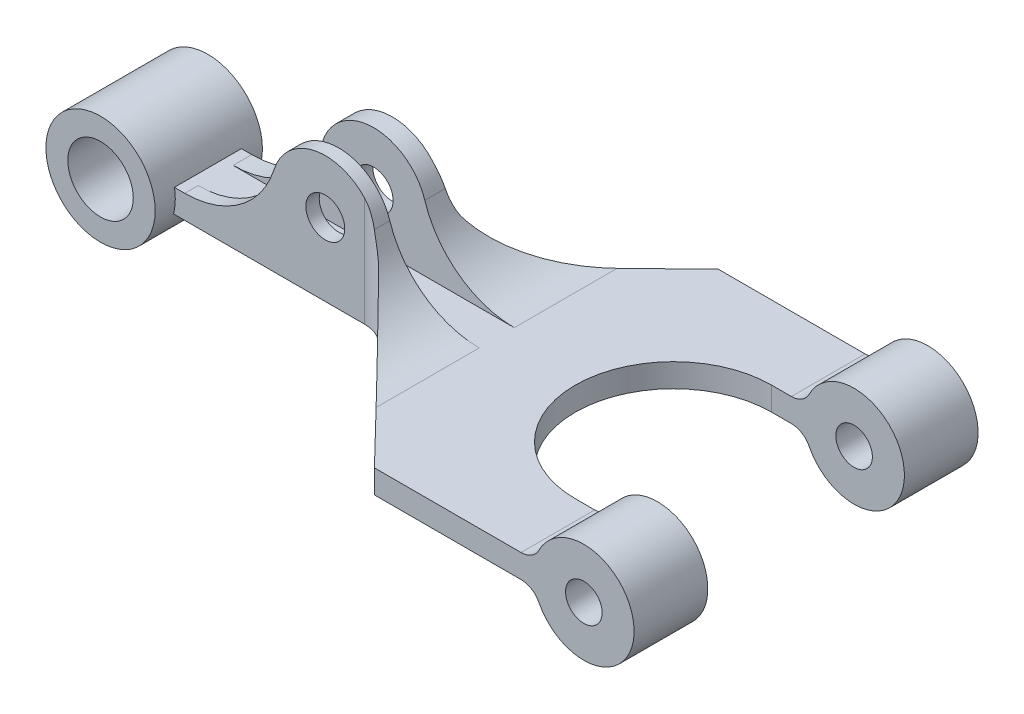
ISO-10303-21;
HEADER;
FILE_DESCRIPTION(('STEP AP214'),'2;1');
FILE_NAME('part.step','',(''),(''),'','','');
FILE_SCHEMA(('AUTOMOTIVE_DESIGN { 1 0 10303 214 1 1 1 1 }'));
ENDSEC;
DATA;
#1=APPLICATION_CONTEXT('core data for automotive mechanical design processes');
#2=APPLICATION_PROTOCOL_DEFINITION('international standard','automotive_design',2000,#1);
#3=PRODUCT_CONTEXT('',#1,'mechanical');
#4=PRODUCT('Part','Part','',(#3));
#5=PRODUCT_RELATED_PRODUCT_CATEGORY('part','',(#4));
#6=PRODUCT_DEFINITION_FORMATION('','',#4);
#7=PRODUCT_DEFINITION_CONTEXT('part definition',#1,'design');
#8=PRODUCT_DEFINITION('design','',#6,#7);
#9=PRODUCT_DEFINITION_SHAPE('','',#8);
#10=(LENGTH_UNIT() NAMED_UNIT(*) SI_UNIT(.MILLI.,.METRE.));
#11=(NAMED_UNIT(*) PLANE_ANGLE_UNIT() SI_UNIT($,.RADIAN.));
#12=(NAMED_UNIT(*) SI_UNIT($,.STERADIAN.) SOLID_ANGLE_UNIT());
#13=UNCERTAINTY_MEASURE_WITH_UNIT(LENGTH_MEASURE(1.E-05),#10,'distance_accuracy_value','');
#14=(GEOMETRIC_REPRESENTATION_CONTEXT(3) GLOBAL_UNCERTAINTY_ASSIGNED_CONTEXT((#13)) GLOBAL_UNIT_ASSIGNED_CONTEXT((#10,
#11,#12)) REPRESENTATION_CONTEXT('',''));
#15=CARTESIAN_POINT('',(0.,0.,0.));
#16=DIRECTION('',(0.,0.,1.));
#17=DIRECTION('',(1.,0.,0.));
#18=AXIS2_PLACEMENT_3D('',#15,#16,#17);
#19=CARTESIAN_POINT('',(12.7411288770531,-63.13435232,-10.));
#20=DIRECTION('',(0.,0.,1.));
#21=DIRECTION('',(1.,0.,0.));
#22=AXIS2_PLACEMENT_3D('',#19,#20,#21);
#23=CYLINDRICAL_SURFACE('',#22,8.);
#24=CARTESIAN_POINT('',(12.7411288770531,-63.13435232,-1.99189092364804));
#25=DIRECTION('',(0.,0.,-1.));
#26=DIRECTION('',(0.,1.,0.));
#27=AXIS2_PLACEMENT_3D('',#24,#25,#26);
#28=CIRCLE('',#27,8.);
#29=CARTESIAN_POINT('',(20.3687027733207,-60.7218605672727,-1.99189092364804));
#30=VERTEX_POINT('',#29);
#31=CARTESIAN_POINT('',(5.11355498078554,-60.7218605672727,-1.99189092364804));
#32=VERTEX_POINT('',#31);
#33=EDGE_CURVE('E255',#30,#32,#28,.F.);
#34=ORIENTED_EDGE('',*,*,#33,.T.);
#35=DIRECTION('',(0.,0.,1.));
#36=VECTOR('',#35,1.);
#37=CARTESIAN_POINT('',(5.11355498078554,-60.7218605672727,-10.));
#38=LINE('',#37,#36);
#39=CARTESIAN_POINT('',(5.11355498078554,-60.7218605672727,0.));
#40=VERTEX_POINT('',#39);
#41=EDGE_CURVE('E333',#32,#40,#38,.T.);
#42=ORIENTED_EDGE('',*,*,#41,.T.);
#43=CARTESIAN_POINT('',(12.7411288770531,-63.13435232,0.));
#44=DIRECTION('',(0.,0.,1.));
#45=DIRECTION('',(1.,0.,0.));
#46=AXIS2_PLACEMENT_3D('',#43,#44,#45);
#47=CIRCLE('',#46,8.);
#48=CARTESIAN_POINT('',(18.6229943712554,-57.7118382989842,0.));
#49=VERTEX_POINT('',#48);
#50=EDGE_CURVE('E313',#49,#40,#47,.T.);
#51=ORIENTED_EDGE('',*,*,#50,.F.);
#52=CARTESIAN_POINT('',(18.6229943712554,-57.7118382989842,0.));
#53=CARTESIAN_POINT('',(18.7685939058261,-57.8697280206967,2.91416028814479E-05));
#54=CARTESIAN_POINT('',(18.9076779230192,-58.0333950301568,0.00635625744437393));
#55=CARTESIAN_POINT('',(19.171906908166,-58.3708607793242,0.0284484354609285));
#56=CARTESIAN_POINT('',(19.2970617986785,-58.5446521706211,0.0442067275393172));
#57=CARTESIAN_POINT('',(19.5306743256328,-58.8980556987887,0.0816816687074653));
#58=CARTESIAN_POINT('',(19.6393857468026,-59.0775128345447,0.103289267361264));
#59=CARTESIAN_POINT('',(19.8422120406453,-59.4440324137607,0.149811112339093));
#60=CARTESIAN_POINT('',(19.9363301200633,-59.6310931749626,0.174724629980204));
#61=CARTESIAN_POINT('',(20.0893222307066,-59.9673745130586,0.219344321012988));
#62=CARTESIAN_POINT('',(20.1512914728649,-60.1152162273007,0.238906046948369));
#63=CARTESIAN_POINT('',(20.26665757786,-60.4154463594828,0.277494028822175));
#64=CARTESIAN_POINT('',(20.319993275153,-60.5678588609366,0.296515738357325));
#65=CARTESIAN_POINT('',(20.3687027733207,-60.7218605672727,0.314650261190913));
#66=B_SPLINE_CURVE_WITH_KNOTS('',3,(#52,#53,#54,#55,#56,#57,#58,#59,#60,#61,#62,#63,#64,#65),
.UNSPECIFIED.,.F.,.F.,(4,2,2,2,2,2,4),(0.,0.643821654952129,1.2871817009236,1.91928757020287,
2.55125434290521,3.0354583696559,3.52295539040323),.UNSPECIFIED.);
#67=CARTESIAN_POINT('',(20.3687027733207,-60.7218605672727,0.314650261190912));
#68=VERTEX_POINT('',#67);
#69=EDGE_CURVE('E404',#49,#68,#66,.T.);
#70=ORIENTED_EDGE('',*,*,#69,.T.);
#71=DIRECTION('',(0.,0.,1.));
#72=VECTOR('',#71,1.);
#73=CARTESIAN_POINT('',(20.3687027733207,-60.7218605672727,-10.));
#74=LINE('',#73,#72);
#75=EDGE_CURVE('E72',#68,#30,#74,.F.);
#76=ORIENTED_EDGE('',*,*,#75,.T.);
#77=EDGE_LOOP('',(#34,#42,#51,#70,#76));
#78=FACE_BOUND('',#77,.T.);
#79=ADVANCED_FACE('F43',(#78),#23,.T.);
#80=DIRECTION('',(0.,0.,1.));
#81=VECTOR('',#80,1.);
#82=CARTESIAN_POINT('',(20.3687027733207,-60.7218605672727,-10.));
#83=LINE('',#82,#81);
#84=CARTESIAN_POINT('',(20.3687027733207,-60.7218605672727,-7.21988533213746));
#85=VERTEX_POINT('',#84);
#86=CARTESIAN_POINT('',(20.3687027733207,-60.7218605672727,-10.2807551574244));
#87=VERTEX_POINT('',#86);
#88=EDGE_CURVE('E64',#85,#87,#83,.F.);
#89=ORIENTED_EDGE('',*,*,#88,.T.);
#90=CARTESIAN_POINT('',(20.3687027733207,-60.7218605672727,-10.2807551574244));
#91=CARTESIAN_POINT('',(20.3046319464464,-60.5192759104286,-10.2583697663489));
#92=CARTESIAN_POINT('',(20.2325312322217,-60.3193959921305,-10.234554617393));
#93=CARTESIAN_POINT('',(20.0726017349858,-59.925823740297,-10.1865890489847));
#94=CARTESIAN_POINT('',(19.9847565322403,-59.7321381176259,-10.1624383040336));
#95=CARTESIAN_POINT('',(19.7955420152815,-59.3556164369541,-10.1168021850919));
#96=CARTESIAN_POINT('',(19.694447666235,-59.1726471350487,-10.095276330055));
#97=CARTESIAN_POINT('',(19.4780588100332,-58.8149289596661,-10.0570681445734));
#98=CARTESIAN_POINT('',(19.3627758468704,-58.6401735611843,-10.0403819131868));
#99=CARTESIAN_POINT('',(19.1595090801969,-58.3569283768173,-10.0189676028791));
#100=CARTESIAN_POINT('',(19.075325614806,-58.2458596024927,-10.0121060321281));
#101=CARTESIAN_POINT('',(18.9006561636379,-58.0275030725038,-10.0026118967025));
#102=CARTESIAN_POINT('',(18.8101350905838,-57.9202422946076,-10.0000051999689));
#103=CARTESIAN_POINT('',(18.7168165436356,-57.8154091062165,-10.));
#104=B_SPLINE_CURVE_WITH_KNOTS('',3,(#90,#91,#92,#93,#94,#95,#96,#97,#98,#99,#100,#101,#102,
#103),.UNSPECIFIED.,.F.,.F.,(4,2,2,2,2,2,4),(0.,0.640779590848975,1.28223137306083,
1.91201914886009,2.54129786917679,2.95966838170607,3.38057307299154),.UNSPECIFIED.);
#105=CARTESIAN_POINT('',(18.7168165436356,-57.8154091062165,-10.));
#106=VERTEX_POINT('',#105);
#107=EDGE_CURVE('E11',#87,#106,#104,.T.);
#108=ORIENTED_EDGE('',*,*,#107,.T.);
#109=CARTESIAN_POINT('',(12.7411288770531,-63.13435232,-10.));
#110=DIRECTION('',(0.,0.,1.));
#111=DIRECTION('',(1.,0.,0.));
#112=AXIS2_PLACEMENT_3D('',#109,#110,#111);
#113=CIRCLE('',#112,8.);
#114=CARTESIAN_POINT('',(5.11355498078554,-60.7218605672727,-10.));
#115=VERTEX_POINT('',#114);
#116=EDGE_CURVE('E320',#106,#115,#113,.T.);
#117=ORIENTED_EDGE('',*,*,#116,.T.);
#118=DIRECTION('',(0.,0.,1.));
#119=VECTOR('',#118,1.);
#120=CARTESIAN_POINT('',(5.11355498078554,-60.7218605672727,-10.));
#121=LINE('',#120,#119);
#122=CARTESIAN_POINT('',(5.11355498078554,-60.7218605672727,-7.21988533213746));
#123=VERTEX_POINT('',#122);
#124=EDGE_CURVE('E340',#115,#123,#121,.T.);
#125=ORIENTED_EDGE('',*,*,#124,.T.);
#126=CARTESIAN_POINT('',(12.7411288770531,-63.13435232,-7.21988533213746));
#127=DIRECTION('',(0.,0.,1.));
#128=DIRECTION('',(0.,-1.,0.));
#129=AXIS2_PLACEMENT_3D('',#126,#127,#128);
#130=CIRCLE('',#129,8.);
#131=EDGE_CURVE('E493',#123,#85,#130,.F.);
#132=ORIENTED_EDGE('',*,*,#131,.T.);
#133=EDGE_LOOP('',(#89,#108,#117,#125,#132));
#134=FACE_BOUND('',#133,.T.);
#135=ADVANCED_FACE('F425',(#134),#23,.T.);
#136=CARTESIAN_POINT('',(12.7411288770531,-63.13435232,-10.));
#137=DIRECTION('',(0.,0.,1.));
#138=DIRECTION('',(1.,0.,0.));
#139=AXIS2_PLACEMENT_3D('',#136,#137,#138);
#140=CYLINDRICAL_SURFACE('',#139,2.9);
#141=CARTESIAN_POINT('',(12.7411288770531,-63.13435232,0.));
#142=DIRECTION('',(0.,0.,1.));
#143=DIRECTION('',(1.,0.,0.));
#144=AXIS2_PLACEMENT_3D('',#141,#142,#143);
#145=CIRCLE('',#144,2.9);
#146=CARTESIAN_POINT('',(15.6411288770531,-63.13435232,0.));
#147=VERTEX_POINT('',#146);
#148=EDGE_CURVE('E309',#147,#147,#145,.T.);
#149=ORIENTED_EDGE('',*,*,#148,.T.);
#150=EDGE_LOOP('',(#149));
#151=FACE_BOUND('',#150,.T.);
#152=CARTESIAN_POINT('',(12.7411288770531,-63.13435232,-1.99189092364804));
#153=DIRECTION('',(0.,0.,-1.));
#154=DIRECTION('',(0.,1.,0.));
#155=AXIS2_PLACEMENT_3D('',#152,#153,#154);
#156=CIRCLE('',#155,2.9);
#157=CARTESIAN_POINT('',(12.7411288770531,-60.23435232,-1.99189092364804));
#158=VERTEX_POINT('',#157);
#159=EDGE_CURVE('E260',#158,#158,#156,.F.);
#160=ORIENTED_EDGE('',*,*,#159,.F.);
#161=EDGE_LOOP('',(#160));
#162=FACE_BOUND('',#161,.T.);
#163=ADVANCED_FACE('F500',(#151,#162),#140,.F.);
#164=CARTESIAN_POINT('',(12.7411288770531,-63.13435232,-10.));
#165=DIRECTION('',(0.,0.,1.));
#166=DIRECTION('',(1.,0.,0.));
#167=AXIS2_PLACEMENT_3D('',#164,#165,#166);
#168=CIRCLE('',#167,2.9);
#169=CARTESIAN_POINT('',(15.6411288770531,-63.13435232,-10.));
#170=VERTEX_POINT('',#169);
#171=EDGE_CURVE('E311',#170,#170,#168,.T.);
#172=ORIENTED_EDGE('',*,*,#171,.F.);
#173=EDGE_LOOP('',(#172));
#174=FACE_BOUND('',#173,.T.);
#175=CARTESIAN_POINT('',(12.7411288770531,-63.13435232,-7.21988533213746));
#176=DIRECTION('',(0.,0.,1.));
#177=DIRECTION('',(0.,-1.,0.));
#178=AXIS2_PLACEMENT_3D('',#175,#176,#177);
#179=CIRCLE('',#178,2.9);
#180=CARTESIAN_POINT('',(12.7411288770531,-66.03435232,-7.21988533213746));
#181=VERTEX_POINT('',#180);
#182=EDGE_CURVE('E486',#181,#181,#179,.F.);
#183=ORIENTED_EDGE('',*,*,#182,.F.);
#184=EDGE_LOOP('',(#183));
#185=FACE_BOUND('',#184,.T.);
#186=ADVANCED_FACE('F497',(#174,#185),#140,.F.);
#187=CARTESIAN_POINT('',(12.7411288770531,-63.13435232,-10.));
#188=DIRECTION('',(0.,0.,1.));
#189=DIRECTION('',(1.,0.,0.));
#190=AXIS2_PLACEMENT_3D('',#187,#188,#189);
#191=PLANE('',#190);
#192=ORIENTED_EDGE('',*,*,#171,.T.);
#193=EDGE_LOOP('',(#192));
#194=FACE_BOUND('',#193,.T.);
#195=ORIENTED_EDGE('',*,*,#116,.F.);
#196=DIRECTION('',(0.,-1.,0.));
#197=VECTOR('',#196,1.);
#198=CARTESIAN_POINT('',(18.7168165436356,-74.,-10.));
#199=LINE('',#198,#197);
#200=CARTESIAN_POINT('',(18.7168165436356,-74.,-10.));
#201=VERTEX_POINT('',#200);
#202=EDGE_CURVE('E398',#106,#201,#199,.T.);
#203=ORIENTED_EDGE('',*,*,#202,.T.);
#204=DIRECTION('',(-1.,0.,0.));
#205=VECTOR('',#204,1.);
#206=CARTESIAN_POINT('',(12.7411288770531,-74.,-10.));
#207=LINE('',#206,#205);
#208=CARTESIAN_POINT('',(-9.90111649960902,-74.,-10.));
#209=VERTEX_POINT('',#208);
#210=EDGE_CURVE('E277',#201,#209,#207,.T.);
#211=ORIENTED_EDGE('',*,*,#210,.T.);
#212=CARTESIAN_POINT('',(-17.7935503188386,-71.9601711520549,-10.));
#213=DIRECTION('',(0.,0.,1.));
#214=DIRECTION('',(1.,0.,0.));
#215=AXIS2_PLACEMENT_3D('',#212,#213,#214);
#216=CIRCLE('',#215,8.15177363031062);
#217=CARTESIAN_POINT('',(-9.7736180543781,-70.5,-10.));
#218=VERTEX_POINT('',#217);
#219=EDGE_CURVE('E230',#209,#218,#216,.T.);
#220=ORIENTED_EDGE('',*,*,#219,.T.);
#221=DIRECTION('',(-1.,0.,0.));
#222=VECTOR('',#221,1.);
#223=CARTESIAN_POINT('',(12.7411288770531,-70.5,-10.));
#224=LINE('',#223,#222);
#225=CARTESIAN_POINT('',(-8.23469933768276,-70.5,-10.));
#226=VERTEX_POINT('',#225);
#227=EDGE_CURVE('E298',#226,#218,#224,.T.);
#228=ORIENTED_EDGE('',*,*,#227,.F.);
#229=CARTESIAN_POINT('',(-8.23469933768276,-56.5,-10.));
#230=DIRECTION('',(0.,0.,1.));
#231=DIRECTION('',(1.,0.,0.));
#232=AXIS2_PLACEMENT_3D('',#229,#230,#231);
#233=CIRCLE('',#232,14.);
#234=EDGE_CURVE('E344',#226,#115,#233,.T.);
#235=ORIENTED_EDGE('',*,*,#234,.T.);
#236=EDGE_LOOP('',(#195,#203,#211,#220,#228,#235));
#237=FACE_BOUND('',#236,.T.);
#238=ADVANCED_FACE('F504',(#194,#237),#191,.F.);
#239=CARTESIAN_POINT('',(12.7411288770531,-63.13435232,0.));
#240=DIRECTION('',(0.,0.,1.));
#241=DIRECTION('',(1.,0.,0.));
#242=AXIS2_PLACEMENT_3D('',#239,#240,#241);
#243=PLANE('',#242);
#244=DIRECTION('',(1.,0.,0.));
#245=VECTOR('',#244,1.);
#246=CARTESIAN_POINT('',(20.7411288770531,-74.,0.));
#247=LINE('',#246,#245);
#248=CARTESIAN_POINT('',(-9.90111649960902,-74.,0.));
#249=VERTEX_POINT('',#248);
#250=CARTESIAN_POINT('',(18.6229943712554,-74.,0.));
#251=VERTEX_POINT('',#250);
#252=EDGE_CURVE('E241',#249,#251,#247,.T.);
#253=ORIENTED_EDGE('',*,*,#252,.T.);
#254=DIRECTION('',(0.,-1.,0.));
#255=VECTOR('',#254,1.);
#256=CARTESIAN_POINT('',(18.6229943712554,-63.13435232,0.));
#257=LINE('',#256,#255);
#258=EDGE_CURVE('E397',#251,#49,#257,.F.);
#259=ORIENTED_EDGE('',*,*,#258,.T.);
#260=ORIENTED_EDGE('',*,*,#50,.T.);
#261=CARTESIAN_POINT('',(-8.23469933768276,-56.5,0.));
#262=DIRECTION('',(0.,0.,1.));
#263=DIRECTION('',(1.,0.,0.));
#264=AXIS2_PLACEMENT_3D('',#261,#262,#263);
#265=CIRCLE('',#264,14.);
#266=CARTESIAN_POINT('',(-8.23469933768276,-70.5,0.));
#267=VERTEX_POINT('',#266);
#268=EDGE_CURVE('E342',#40,#267,#265,.F.);
#269=ORIENTED_EDGE('',*,*,#268,.T.);
#270=DIRECTION('',(1.,0.,0.));
#271=VECTOR('',#270,1.);
#272=CARTESIAN_POINT('',(20.7411288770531,-70.5,0.));
#273=LINE('',#272,#271);
#274=CARTESIAN_POINT('',(-9.7736180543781,-70.5,0.));
#275=VERTEX_POINT('',#274);
#276=EDGE_CURVE('E242',#275,#267,#273,.T.);
#277=ORIENTED_EDGE('',*,*,#276,.F.);
#278=CARTESIAN_POINT('',(-17.7935503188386,-71.9601711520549,0.));
#279=DIRECTION('',(0.,0.,1.));
#280=DIRECTION('',(1.,0.,0.));
#281=AXIS2_PLACEMENT_3D('',#278,#279,#280);
#282=CIRCLE('',#281,8.15177363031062);
#283=EDGE_CURVE('E228',#249,#275,#282,.T.);
#284=ORIENTED_EDGE('',*,*,#283,.F.);
#285=EDGE_LOOP('',(#253,#259,#260,#269,#277,#284));
#286=FACE_BOUND('',#285,.T.);
#287=ORIENTED_EDGE('',*,*,#148,.F.);
#288=EDGE_LOOP('',(#287));
#289=FACE_BOUND('',#288,.T.);
#290=ADVANCED_FACE('F237',(#286,#289),#243,.T.);
#291=CARTESIAN_POINT('',(60.343112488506,-70.5,-4.33827992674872));
#292=DIRECTION('',(0.,1.,0.));
#293=DIRECTION('',(0.,0.,1.));
#294=AXIS2_PLACEMENT_3D('',#291,#292,#293);
#295=PLANE('',#294);
#296=DIRECTION('',(1.,0.,0.));
#297=VECTOR('',#296,1.);
#298=CARTESIAN_POINT('',(41.3922499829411,-70.5,21.3234401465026));
#299=LINE('',#298,#297);
#300=CARTESIAN_POINT('',(41.3922499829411,-70.5,21.3234401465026));
#301=VERTEX_POINT('',#300);
#302=CARTESIAN_POINT('',(63.2719281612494,-70.5,21.3234401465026));
#303=VERTEX_POINT('',#302);
#304=EDGE_CURVE('E282',#301,#303,#299,.T.);
#305=ORIENTED_EDGE('',*,*,#304,.T.);
#306=DIRECTION('',(0.,0.,-1.));
#307=VECTOR('',#306,1.);
#308=CARTESIAN_POINT('',(63.2719281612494,-70.5,10.3234401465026));
#309=LINE('',#308,#307);
#310=CARTESIAN_POINT('',(63.2719281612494,-70.5,10.3234401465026));
#311=VERTEX_POINT('',#310);
#312=EDGE_CURVE('E367',#303,#311,#309,.T.);
#313=ORIENTED_EDGE('',*,*,#312,.T.);
#314=DIRECTION('',(-1.,0.,0.));
#315=VECTOR('',#314,1.);
#316=CARTESIAN_POINT('',(60.343112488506,-70.5,10.3234401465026));
#317=LINE('',#316,#315);
#318=CARTESIAN_POINT('',(60.343112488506,-70.5,10.3234401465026));
#319=VERTEX_POINT('',#318);
#320=EDGE_CURVE('E281',#311,#319,#317,.T.);
#321=ORIENTED_EDGE('',*,*,#320,.T.);
#322=CARTESIAN_POINT('',(60.343112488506,-70.5,-4.33827992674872));
#323=DIRECTION('',(0.,-1.,0.));
#324=DIRECTION('',(0.,0.,1.));
#325=AXIS2_PLACEMENT_3D('',#322,#323,#324);
#326=CIRCLE('',#325,14.6617200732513);
#327=CARTESIAN_POINT('',(60.343112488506,-70.5,-19.));
#328=VERTEX_POINT('',#327);
#329=EDGE_CURVE('E287',#319,#328,#326,.T.);
#330=ORIENTED_EDGE('',*,*,#329,.T.);
#331=DIRECTION('',(1.,0.,0.));
#332=VECTOR('',#331,1.);
#333=CARTESIAN_POINT('',(65.343112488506,-70.5,-19.));
#334=LINE('',#333,#332);
#335=CARTESIAN_POINT('',(63.2719281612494,-70.5,-19.));
#336=VERTEX_POINT('',#335);
#337=EDGE_CURVE('E290',#328,#336,#334,.T.);
#338=ORIENTED_EDGE('',*,*,#337,.T.);
#339=DIRECTION('',(0.,0.,-1.));
#340=VECTOR('',#339,1.);
#341=CARTESIAN_POINT('',(63.2719281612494,-70.5,-4.33827992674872));
#342=LINE('',#341,#340);
#343=CARTESIAN_POINT('',(63.2719281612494,-70.5,-30.));
#344=VERTEX_POINT('',#343);
#345=EDGE_CURVE('E366',#336,#344,#342,.T.);
#346=ORIENTED_EDGE('',*,*,#345,.T.);
#347=DIRECTION('',(-1.,0.,0.));
#348=VECTOR('',#347,1.);
#349=CARTESIAN_POINT('',(41.3922499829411,-70.5,-30.));
#350=LINE('',#349,#348);
#351=CARTESIAN_POINT('',(41.3922499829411,-70.5,-30.));
#352=VERTEX_POINT('',#351);
#353=EDGE_CURVE('E293',#344,#352,#350,.T.);
#354=ORIENTED_EDGE('',*,*,#353,.T.);
#355=DIRECTION('',(-0.718340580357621,0.,0.695691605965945));
#356=VECTOR('',#355,1.);
#357=CARTESIAN_POINT('',(20.7411288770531,-70.5,-10.));
#358=LINE('',#357,#356);
#359=CARTESIAN_POINT('',(33.716957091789,-70.5,-22.5667058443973));
#360=VERTEX_POINT('',#359);
#361=EDGE_CURVE('E291',#352,#360,#358,.T.);
#362=ORIENTED_EDGE('',*,*,#361,.T.);
#363=DIRECTION('',(0.,0.,-1.));
#364=VECTOR('',#363,1.);
#365=CARTESIAN_POINT('',(33.716957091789,-70.5,-7.21988533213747));
#366=LINE('',#365,#364);
#367=CARTESIAN_POINT('',(33.716957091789,-70.5,-7.21988533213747));
#368=VERTEX_POINT('',#367);
#369=EDGE_CURVE('E324',#360,#368,#366,.F.);
#370=ORIENTED_EDGE('',*,*,#369,.T.);
#371=DIRECTION('',(-1.,0.,0.));
#372=VECTOR('',#371,1.);
#373=CARTESIAN_POINT('',(65.343112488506,-70.5,-7.21988533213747));
#374=LINE('',#373,#372);
#375=CARTESIAN_POINT('',(-8.23469933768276,-70.5,-7.21988533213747));
#376=VERTEX_POINT('',#375);
#377=EDGE_CURVE('E485',#368,#376,#374,.T.);
#378=ORIENTED_EDGE('',*,*,#377,.T.);
#379=DIRECTION('',(0.,0.,-1.));
#380=VECTOR('',#379,1.);
#381=CARTESIAN_POINT('',(-8.23469933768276,-70.5,-10.));
#382=LINE('',#381,#380);
#383=EDGE_CURVE('E329',#376,#226,#382,.T.);
#384=ORIENTED_EDGE('',*,*,#383,.T.);
#385=ORIENTED_EDGE('',*,*,#227,.T.);
#386=DIRECTION('',(0.,0.,1.));
#387=VECTOR('',#386,1.);
#388=CARTESIAN_POINT('',(-9.7736180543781,-70.5,-13.));
#389=LINE('',#388,#387);
#390=EDGE_CURVE('E466',#275,#218,#389,.F.);
#391=ORIENTED_EDGE('',*,*,#390,.F.);
#392=ORIENTED_EDGE('',*,*,#276,.T.);
#393=DIRECTION('',(0.,0.,-1.));
#394=VECTOR('',#393,1.);
#395=CARTESIAN_POINT('',(-8.23469933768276,-70.5,-1.99189092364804));
#396=LINE('',#395,#394);
#397=CARTESIAN_POINT('',(-8.23469933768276,-70.5,-1.99189092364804));
#398=VERTEX_POINT('',#397);
#399=EDGE_CURVE('E328',#267,#398,#396,.T.);
#400=ORIENTED_EDGE('',*,*,#399,.T.);
#401=DIRECTION('',(-1.,0.,0.));
#402=VECTOR('',#401,1.);
#403=CARTESIAN_POINT('',(65.343112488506,-70.5,-1.99189092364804));
#404=LINE('',#403,#402);
#405=CARTESIAN_POINT('',(33.716957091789,-70.5,-1.99189092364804));
#406=VERTEX_POINT('',#405);
#407=EDGE_CURVE('E470',#406,#398,#404,.T.);
#408=ORIENTED_EDGE('',*,*,#407,.F.);
#409=DIRECTION('',(0.,0.,-1.));
#410=VECTOR('',#409,1.);
#411=CARTESIAN_POINT('',(33.716957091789,-70.5,0.));
#412=LINE('',#411,#410);
#413=CARTESIAN_POINT('',(33.716957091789,-70.5,13.3982699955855));
#414=VERTEX_POINT('',#413);
#415=EDGE_CURVE('E316',#406,#414,#412,.F.);
#416=ORIENTED_EDGE('',*,*,#415,.T.);
#417=DIRECTION('',(0.695691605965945,0.,0.718340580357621));
#418=VECTOR('',#417,1.);
#419=CARTESIAN_POINT('',(20.7411288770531,-70.5,0.));
#420=LINE('',#419,#418);
#421=EDGE_CURVE('E276',#414,#301,#420,.T.);
#422=ORIENTED_EDGE('',*,*,#421,.T.);
#423=EDGE_LOOP('',(#305,#313,#321,#330,#338,#346,#354,#362,#370,#378,#384,#385,#391,#392,#400,
#408,#416,#422));
#424=FACE_BOUND('',#423,.T.);
#425=ADVANCED_FACE('F467',(#424),#295,.T.);
#426=CARTESIAN_POINT('',(20.7411288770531,-70.5,0.));
#427=DIRECTION('',(0.718340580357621,0.,-0.695691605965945));
#428=DIRECTION('',(-0.695691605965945,0.,-0.718340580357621));
#429=AXIS2_PLACEMENT_3D('',#426,#427,#428);
#430=PLANE('',#429);
#431=CARTESIAN_POINT('',(33.716957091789,-56.5,13.3982699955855));
#432=DIRECTION('',(0.718340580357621,0.,-0.695691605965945));
#433=DIRECTION('',(0.695691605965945,0.,0.718340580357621));
#434=AXIS2_PLACEMENT_3D('',#431,#432,#433);
#435=ELLIPSE('',#434,20.1238593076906,14.);
#436=CARTESIAN_POINT('',(22.2146972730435,-64.481103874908,1.52154197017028));
#437=VERTEX_POINT('',#436);
#438=EDGE_CURVE('E355',#414,#437,#435,.T.);
#439=ORIENTED_EDGE('',*,*,#438,.T.);
#440=DIRECTION('',(0.,-1.,0.));
#441=VECTOR('',#440,1.);
#442=CARTESIAN_POINT('',(22.2146972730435,-70.5,1.52154197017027));
#443=LINE('',#442,#441);
#444=CARTESIAN_POINT('',(22.2146972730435,-74.,1.52154197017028));
#445=VERTEX_POINT('',#444);
#446=EDGE_CURVE('E395',#437,#445,#443,.T.);
#447=ORIENTED_EDGE('',*,*,#446,.T.);
#448=DIRECTION('',(0.695691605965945,0.,0.718340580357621));
#449=VECTOR('',#448,1.);
#450=CARTESIAN_POINT('',(20.7411288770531,-74.,0.));
#451=LINE('',#450,#449);
#452=CARTESIAN_POINT('',(41.3922499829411,-74.,21.3234401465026));
#453=VERTEX_POINT('',#452);
#454=EDGE_CURVE('E252',#445,#453,#451,.T.);
#455=ORIENTED_EDGE('',*,*,#454,.T.);
#456=DIRECTION('',(0.,-1.,0.));
#457=VECTOR('',#456,1.);
#458=CARTESIAN_POINT('',(41.3922499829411,-70.5,21.3234401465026));
#459=LINE('',#458,#457);
#460=EDGE_CURVE('E310',#301,#453,#459,.T.);
#461=ORIENTED_EDGE('',*,*,#460,.F.);
#462=ORIENTED_EDGE('',*,*,#421,.F.);
#463=EDGE_LOOP('',(#439,#447,#455,#461,#462));
#464=FACE_BOUND('',#463,.T.);
#465=ADVANCED_FACE('F456',(#464),#430,.F.);
#466=CARTESIAN_POINT('',(41.3922499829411,-70.5,21.3234401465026));
#467=DIRECTION('',(0.,0.,-1.));
#468=DIRECTION('',(-1.,0.,0.));
#469=AXIS2_PLACEMENT_3D('',#466,#467,#468);
#470=PLANE('',#469);
#471=DIRECTION('',(1.,0.,0.));
#472=VECTOR('',#471,1.);
#473=CARTESIAN_POINT('',(41.3922499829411,-74.,21.3234401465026));
#474=LINE('',#473,#472);
#475=CARTESIAN_POINT('',(63.2719281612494,-74.,21.3234401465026));
#476=VERTEX_POINT('',#475);
#477=EDGE_CURVE('E251',#453,#476,#474,.T.);
#478=ORIENTED_EDGE('',*,*,#477,.T.);
#479=CARTESIAN_POINT('',(63.2719281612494,-77.,21.3234401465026));
#480=DIRECTION('',(0.,0.,-1.));
#481=DIRECTION('',(-1.,0.,0.));
#482=AXIS2_PLACEMENT_3D('',#479,#480,#481);
#483=CIRCLE('',#482,3.);
#484=CARTESIAN_POINT('',(65.9474025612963,-75.6428571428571,21.3234401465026));
#485=VERTEX_POINT('',#484);
#486=EDGE_CURVE('E378',#476,#485,#483,.T.);
#487=ORIENTED_EDGE('',*,*,#486,.T.);
#488=CARTESIAN_POINT('',(72.6360885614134,-72.25,21.3234401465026));
#489=DIRECTION('',(0.,0.,1.));
#490=DIRECTION('',(1.,0.,0.));
#491=AXIS2_PLACEMENT_3D('',#488,#489,#490);
#492=CIRCLE('',#491,7.50000000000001);
#493=CARTESIAN_POINT('',(65.9474025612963,-68.8571428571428,21.3234401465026));
#494=VERTEX_POINT('',#493);
#495=EDGE_CURVE('E479',#485,#494,#492,.T.);
#496=ORIENTED_EDGE('',*,*,#495,.T.);
#497=CARTESIAN_POINT('',(63.2719281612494,-67.5,21.3234401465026));
#498=DIRECTION('',(0.,0.,-1.));
#499=DIRECTION('',(-1.,0.,0.));
#500=AXIS2_PLACEMENT_3D('',#497,#498,#499);
#501=CIRCLE('',#500,3.);
#502=EDGE_CURVE('E384',#494,#303,#501,.T.);
#503=ORIENTED_EDGE('',*,*,#502,.T.);
#504=ORIENTED_EDGE('',*,*,#304,.F.);
#505=ORIENTED_EDGE('',*,*,#460,.T.);
#506=EDGE_LOOP('',(#478,#487,#496,#503,#504,#505));
#507=FACE_BOUND('',#506,.T.);
#508=CARTESIAN_POINT('',(72.6360885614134,-72.25,21.3234401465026));
#509=DIRECTION('',(0.,0.,1.));
#510=DIRECTION('',(1.,0.,0.));
#511=AXIS2_PLACEMENT_3D('',#508,#509,#510);
#512=CIRCLE('',#511,2.72660472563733);
#513=CARTESIAN_POINT('',(75.3626932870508,-72.25,21.3234401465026));
#514=VERTEX_POINT('',#513);
#515=EDGE_CURVE('E468',#514,#514,#512,.T.);
#516=ORIENTED_EDGE('',*,*,#515,.F.);
#517=EDGE_LOOP('',(#516));
#518=FACE_BOUND('',#517,.T.);
#519=ADVANCED_FACE('F620',(#507,#518),#470,.F.);
#520=CARTESIAN_POINT('',(60.343112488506,-70.5,10.3234401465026));
#521=DIRECTION('',(0.,0.,1.));
#522=DIRECTION('',(1.,0.,0.));
#523=AXIS2_PLACEMENT_3D('',#520,#521,#522);
#524=PLANE('',#523);
#525=ORIENTED_EDGE('',*,*,#320,.F.);
#526=CARTESIAN_POINT('',(63.2719281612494,-67.5,10.3234401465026));
#527=DIRECTION('',(0.,0.,1.));
#528=DIRECTION('',(1.,0.,0.));
#529=AXIS2_PLACEMENT_3D('',#526,#527,#528);
#530=CIRCLE('',#529,3.);
#531=CARTESIAN_POINT('',(65.9474025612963,-68.8571428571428,10.3234401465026));
#532=VERTEX_POINT('',#531);
#533=EDGE_CURVE('E382',#311,#532,#530,.T.);
#534=ORIENTED_EDGE('',*,*,#533,.T.);
#535=CARTESIAN_POINT('',(72.6360885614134,-72.25,10.3234401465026));
#536=DIRECTION('',(0.,0.,1.));
#537=DIRECTION('',(1.,0.,0.));
#538=AXIS2_PLACEMENT_3D('',#535,#536,#537);
#539=CIRCLE('',#538,7.50000000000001);
#540=CARTESIAN_POINT('',(65.9474025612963,-75.6428571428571,10.3234401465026));
#541=VERTEX_POINT('',#540);
#542=EDGE_CURVE('E478',#541,#532,#539,.T.);
#543=ORIENTED_EDGE('',*,*,#542,.F.);
#544=CARTESIAN_POINT('',(63.2719281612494,-77.,10.3234401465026));
#545=DIRECTION('',(0.,0.,1.));
#546=DIRECTION('',(1.,0.,0.));
#547=AXIS2_PLACEMENT_3D('',#544,#545,#546);
#548=CIRCLE('',#547,3.);
#549=CARTESIAN_POINT('',(63.2719281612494,-74.,10.3234401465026));
#550=VERTEX_POINT('',#549);
#551=EDGE_CURVE('E380',#541,#550,#548,.T.);
#552=ORIENTED_EDGE('',*,*,#551,.T.);
#553=DIRECTION('',(-1.,0.,0.));
#554=VECTOR('',#553,1.);
#555=CARTESIAN_POINT('',(60.343112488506,-74.,10.3234401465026));
#556=LINE('',#555,#554);
#557=CARTESIAN_POINT('',(60.343112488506,-74.,10.3234401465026));
#558=VERTEX_POINT('',#557);
#559=EDGE_CURVE('E265',#550,#558,#556,.T.);
#560=ORIENTED_EDGE('',*,*,#559,.T.);
#561=DIRECTION('',(0.,-1.,0.));
#562=VECTOR('',#561,1.);
#563=CARTESIAN_POINT('',(60.343112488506,-70.5,10.3234401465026));
#564=LINE('',#563,#562);
#565=EDGE_CURVE('E302',#319,#558,#564,.T.);
#566=ORIENTED_EDGE('',*,*,#565,.F.);
#567=EDGE_LOOP('',(#525,#534,#543,#552,#560,#566));
#568=FACE_BOUND('',#567,.T.);
#569=CARTESIAN_POINT('',(72.6360885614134,-72.25,10.3234401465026));
#570=DIRECTION('',(0.,0.,1.));
#571=DIRECTION('',(1.,0.,0.));
#572=AXIS2_PLACEMENT_3D('',#569,#570,#571);
#573=CIRCLE('',#572,2.72660472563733);
#574=CARTESIAN_POINT('',(75.3626932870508,-72.25,10.3234401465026));
#575=VERTEX_POINT('',#574);
#576=EDGE_CURVE('E474',#575,#575,#573,.T.);
#577=ORIENTED_EDGE('',*,*,#576,.T.);
#578=EDGE_LOOP('',(#577));
#579=FACE_BOUND('',#578,.T.);
#580=ADVANCED_FACE('F618',(#568,#579),#524,.F.);
#581=CARTESIAN_POINT('',(60.343112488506,-70.5,-4.33827992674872));
#582=DIRECTION('',(0.,-1.,0.));
#583=DIRECTION('',(0.,0.,-1.));
#584=AXIS2_PLACEMENT_3D('',#581,#582,#583);
#585=CYLINDRICAL_SURFACE('',#584,14.6617200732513);
#586=ORIENTED_EDGE('',*,*,#565,.T.);
#587=CARTESIAN_POINT('',(60.343112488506,-74.,-4.33827992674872));
#588=DIRECTION('',(0.,-1.,0.));
#589=DIRECTION('',(0.,0.,1.));
#590=AXIS2_PLACEMENT_3D('',#587,#588,#589);
#591=CIRCLE('',#590,14.6617200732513);
#592=CARTESIAN_POINT('',(60.343112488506,-74.,-19.));
#593=VERTEX_POINT('',#592);
#594=EDGE_CURVE('E262',#558,#593,#591,.T.);
#595=ORIENTED_EDGE('',*,*,#594,.T.);
#596=DIRECTION('',(0.,-1.,0.));
#597=VECTOR('',#596,1.);
#598=CARTESIAN_POINT('',(60.343112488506,-70.5,-19.));
#599=LINE('',#598,#597);
#600=EDGE_CURVE('E305',#328,#593,#599,.T.);
#601=ORIENTED_EDGE('',*,*,#600,.F.);
#602=ORIENTED_EDGE('',*,*,#329,.F.);
#603=EDGE_LOOP('',(#586,#595,#601,#602));
#604=FACE_BOUND('',#603,.T.);
#605=ADVANCED_FACE('F615',(#604),#585,.F.);
#606=CARTESIAN_POINT('',(65.343112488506,-70.5,-19.));
#607=DIRECTION('',(0.,0.,-1.));
#608=DIRECTION('',(-1.,0.,0.));
#609=AXIS2_PLACEMENT_3D('',#606,#607,#608);
#610=PLANE('',#609);
#611=DIRECTION('',(1.,0.,0.));
#612=VECTOR('',#611,1.);
#613=CARTESIAN_POINT('',(65.343112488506,-74.,-19.));
#614=LINE('',#613,#612);
#615=CARTESIAN_POINT('',(63.2719281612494,-74.,-19.));
#616=VERTEX_POINT('',#615);
#617=EDGE_CURVE('E268',#593,#616,#614,.T.);
#618=ORIENTED_EDGE('',*,*,#617,.T.);
#619=CARTESIAN_POINT('',(63.2719281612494,-77.,-19.));
#620=DIRECTION('',(0.,0.,-1.));
#621=DIRECTION('',(-1.,0.,0.));
#622=AXIS2_PLACEMENT_3D('',#619,#620,#621);
#623=CIRCLE('',#622,3.);
#624=CARTESIAN_POINT('',(65.9474025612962,-75.6428571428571,-19.));
#625=VERTEX_POINT('',#624);
#626=EDGE_CURVE('E390',#616,#625,#623,.T.);
#627=ORIENTED_EDGE('',*,*,#626,.T.);
#628=CARTESIAN_POINT('',(72.6360885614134,-72.25,-19.));
#629=DIRECTION('',(0.,0.,1.));
#630=DIRECTION('',(1.,0.,0.));
#631=AXIS2_PLACEMENT_3D('',#628,#629,#630);
#632=CIRCLE('',#631,7.5);
#633=CARTESIAN_POINT('',(65.9474025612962,-68.8571428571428,-19.));
#634=VERTEX_POINT('',#633);
#635=EDGE_CURVE('E543',#625,#634,#632,.T.);
#636=ORIENTED_EDGE('',*,*,#635,.T.);
#637=CARTESIAN_POINT('',(63.2719281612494,-67.5,-19.));
#638=DIRECTION('',(0.,0.,-1.));
#639=DIRECTION('',(-1.,0.,0.));
#640=AXIS2_PLACEMENT_3D('',#637,#638,#639);
#641=CIRCLE('',#640,3.);
#642=EDGE_CURVE('E394',#634,#336,#641,.T.);
#643=ORIENTED_EDGE('',*,*,#642,.T.);
#644=ORIENTED_EDGE('',*,*,#337,.F.);
#645=ORIENTED_EDGE('',*,*,#600,.T.);
#646=EDGE_LOOP('',(#618,#627,#636,#643,#644,#645));
#647=FACE_BOUND('',#646,.T.);
#648=CARTESIAN_POINT('',(72.6360885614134,-72.25,-19.));
#649=DIRECTION('',(0.,0.,1.));
#650=DIRECTION('',(1.,0.,0.));
#651=AXIS2_PLACEMENT_3D('',#648,#649,#650);
#652=CIRCLE('',#651,2.72500000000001);
#653=CARTESIAN_POINT('',(75.3610885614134,-72.25,-19.));
#654=VERTEX_POINT('',#653);
#655=EDGE_CURVE('E556',#654,#654,#652,.T.);
#656=ORIENTED_EDGE('',*,*,#655,.F.);
#657=EDGE_LOOP('',(#656));
#658=FACE_BOUND('',#657,.T.);
#659=ADVANCED_FACE('F544',(#647,#658),#610,.F.);
#660=CARTESIAN_POINT('',(41.3922499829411,-70.5,-30.));
#661=DIRECTION('',(0.,0.,1.));
#662=DIRECTION('',(1.,0.,0.));
#663=AXIS2_PLACEMENT_3D('',#660,#661,#662);
#664=PLANE('',#663);
#665=ORIENTED_EDGE('',*,*,#353,.F.);
#666=CARTESIAN_POINT('',(63.2719281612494,-67.5,-30.));
#667=DIRECTION('',(0.,0.,1.));
#668=DIRECTION('',(1.,0.,0.));
#669=AXIS2_PLACEMENT_3D('',#666,#667,#668);
#670=CIRCLE('',#669,3.);
#671=CARTESIAN_POINT('',(65.9474025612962,-68.8571428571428,-30.));
#672=VERTEX_POINT('',#671);
#673=EDGE_CURVE('E386',#344,#672,#670,.T.);
#674=ORIENTED_EDGE('',*,*,#673,.T.);
#675=CARTESIAN_POINT('',(72.6360885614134,-72.25,-30.));
#676=DIRECTION('',(0.,0.,1.));
#677=DIRECTION('',(1.,0.,0.));
#678=AXIS2_PLACEMENT_3D('',#675,#676,#677);
#679=CIRCLE('',#678,7.5);
#680=CARTESIAN_POINT('',(65.9474025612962,-75.6428571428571,-30.));
#681=VERTEX_POINT('',#680);
#682=EDGE_CURVE('E551',#681,#672,#679,.T.);
#683=ORIENTED_EDGE('',*,*,#682,.F.);
#684=CARTESIAN_POINT('',(63.2719281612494,-77.,-30.));
#685=DIRECTION('',(0.,0.,1.));
#686=DIRECTION('',(1.,0.,0.));
#687=AXIS2_PLACEMENT_3D('',#684,#685,#686);
#688=CIRCLE('',#687,3.);
#689=CARTESIAN_POINT('',(63.2719281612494,-74.,-30.));
#690=VERTEX_POINT('',#689);
#691=EDGE_CURVE('E383',#681,#690,#688,.T.);
#692=ORIENTED_EDGE('',*,*,#691,.T.);
#693=DIRECTION('',(-1.,0.,0.));
#694=VECTOR('',#693,1.);
#695=CARTESIAN_POINT('',(41.3922499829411,-74.,-30.));
#696=LINE('',#695,#694);
#697=CARTESIAN_POINT('',(41.3922499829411,-74.,-30.));
#698=VERTEX_POINT('',#697);
#699=EDGE_CURVE('E272',#690,#698,#696,.T.);
#700=ORIENTED_EDGE('',*,*,#699,.T.);
#701=DIRECTION('',(0.,-1.,0.));
#702=VECTOR('',#701,1.);
#703=CARTESIAN_POINT('',(41.3922499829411,-70.5,-30.));
#704=LINE('',#703,#702);
#705=EDGE_CURVE('E299',#352,#698,#704,.T.);
#706=ORIENTED_EDGE('',*,*,#705,.F.);
#707=EDGE_LOOP('',(#665,#674,#683,#692,#700,#706));
#708=FACE_BOUND('',#707,.T.);
#709=CARTESIAN_POINT('',(72.6360885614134,-72.25,-30.));
#710=DIRECTION('',(0.,0.,1.));
#711=DIRECTION('',(1.,0.,0.));
#712=AXIS2_PLACEMENT_3D('',#709,#710,#711);
#713=CIRCLE('',#712,2.72500000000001);
#714=CARTESIAN_POINT('',(75.3610885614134,-72.25,-30.));
#715=VERTEX_POINT('',#714);
#716=EDGE_CURVE('E561',#715,#715,#713,.T.);
#717=ORIENTED_EDGE('',*,*,#716,.T.);
#718=EDGE_LOOP('',(#717));
#719=FACE_BOUND('',#718,.T.);
#720=ADVANCED_FACE('F609',(#708,#719),#664,.F.);
#721=CARTESIAN_POINT('',(20.7411288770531,-70.5,-10.));
#722=DIRECTION('',(0.695691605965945,0.,0.718340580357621));
#723=DIRECTION('',(0.718340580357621,0.,-0.695691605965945));
#724=AXIS2_PLACEMENT_3D('',#721,#722,#723);
#725=PLANE('',#724);
#726=DIRECTION('',(-0.718340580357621,0.,0.695691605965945));
#727=VECTOR('',#726,1.);
#728=CARTESIAN_POINT('',(20.7411288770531,-74.,-10.));
#729=LINE('',#728,#727);
#730=CARTESIAN_POINT('',(22.1952745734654,-74.,-11.4082970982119));
#731=VERTEX_POINT('',#730);
#732=EDGE_CURVE('E271',#698,#731,#729,.T.);
#733=ORIENTED_EDGE('',*,*,#732,.T.);
#734=DIRECTION('',(0.,-1.,0.));
#735=VECTOR('',#734,1.);
#736=CARTESIAN_POINT('',(22.1952745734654,-61.7562231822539,-11.4082970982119));
#737=LINE('',#736,#735);
#738=CARTESIAN_POINT('',(22.1952745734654,-64.4530391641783,-11.4082970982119));
#739=VERTEX_POINT('',#738);
#740=EDGE_CURVE('E402',#731,#739,#737,.F.);
#741=ORIENTED_EDGE('',*,*,#740,.T.);
#742=CARTESIAN_POINT('',(33.716957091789,-56.5,-22.5667058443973));
#743=DIRECTION('',(0.695691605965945,0.,0.718340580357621));
#744=DIRECTION('',(-0.718340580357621,0.,0.695691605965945));
#745=AXIS2_PLACEMENT_3D('',#742,#743,#744);
#746=ELLIPSE('',#745,19.4893625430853,14.);
#747=EDGE_CURVE('E352',#739,#360,#746,.T.);
#748=ORIENTED_EDGE('',*,*,#747,.T.);
#749=ORIENTED_EDGE('',*,*,#361,.F.);
#750=ORIENTED_EDGE('',*,*,#705,.T.);
#751=EDGE_LOOP('',(#733,#741,#748,#749,#750));
#752=FACE_BOUND('',#751,.T.);
#753=ADVANCED_FACE('F527',(#752),#725,.F.);
#754=CARTESIAN_POINT('',(60.343112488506,-74.,-4.33827992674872));
#755=DIRECTION('',(0.,1.,0.));
#756=DIRECTION('',(0.,0.,1.));
#757=AXIS2_PLACEMENT_3D('',#754,#755,#756);
#758=PLANE('',#757);
#759=ORIENTED_EDGE('',*,*,#559,.F.);
#760=DIRECTION('',(0.,0.,1.));
#761=VECTOR('',#760,1.);
#762=CARTESIAN_POINT('',(63.2719281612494,-74.,-4.33827992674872));
#763=LINE('',#762,#761);
#764=EDGE_CURVE('E364',#550,#476,#763,.T.);
#765=ORIENTED_EDGE('',*,*,#764,.T.);
#766=ORIENTED_EDGE('',*,*,#477,.F.);
#767=ORIENTED_EDGE('',*,*,#454,.F.);
#768=CARTESIAN_POINT('',(18.6229943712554,-74.,5.));
#769=DIRECTION('',(0.,1.,0.));
#770=DIRECTION('',(0.,0.,1.));
#771=AXIS2_PLACEMENT_3D('',#768,#769,#770);
#772=CIRCLE('',#771,5.);
#773=EDGE_CURVE('E249',#445,#251,#772,.T.);
#774=ORIENTED_EDGE('',*,*,#773,.T.);
#775=ORIENTED_EDGE('',*,*,#252,.F.);
#776=DIRECTION('',(0.,0.,1.));
#777=VECTOR('',#776,1.);
#778=CARTESIAN_POINT('',(-9.90111649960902,-74.,-13.));
#779=LINE('',#778,#777);
#780=EDGE_CURVE('E224',#249,#209,#779,.F.);
#781=ORIENTED_EDGE('',*,*,#780,.T.);
#782=ORIENTED_EDGE('',*,*,#210,.F.);
#783=CARTESIAN_POINT('',(18.7168165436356,-74.,-15.));
#784=DIRECTION('',(0.,1.,0.));
#785=DIRECTION('',(0.,0.,1.));
#786=AXIS2_PLACEMENT_3D('',#783,#784,#785);
#787=CIRCLE('',#786,5.);
#788=EDGE_CURVE('E449',#201,#731,#787,.T.);
#789=ORIENTED_EDGE('',*,*,#788,.T.);
#790=ORIENTED_EDGE('',*,*,#732,.F.);
#791=ORIENTED_EDGE('',*,*,#699,.F.);
#792=DIRECTION('',(0.,0.,1.));
#793=VECTOR('',#792,1.);
#794=CARTESIAN_POINT('',(63.2719281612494,-74.,-19.));
#795=LINE('',#794,#793);
#796=EDGE_CURVE('E365',#690,#616,#795,.T.);
#797=ORIENTED_EDGE('',*,*,#796,.T.);
#798=ORIENTED_EDGE('',*,*,#617,.F.);
#799=ORIENTED_EDGE('',*,*,#594,.F.);
#800=EDGE_LOOP('',(#759,#765,#766,#767,#774,#775,#781,#782,#789,#790,#791,#797,#798,#799));
#801=FACE_BOUND('',#800,.T.);
#802=ADVANCED_FACE('F247',(#801),#758,.F.);
#803=CARTESIAN_POINT('',(65.343112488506,-52.3482254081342,-1.99189092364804));
#804=DIRECTION('',(0.,0.,-1.));
#805=DIRECTION('',(0.,1.,0.));
#806=AXIS2_PLACEMENT_3D('',#803,#804,#805);
#807=PLANE('',#806);
#808=ORIENTED_EDGE('',*,*,#407,.T.);
#809=CARTESIAN_POINT('',(-8.23469933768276,-56.5,-1.99189092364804));
#810=DIRECTION('',(0.,0.,-1.));
#811=DIRECTION('',(0.,1.,0.));
#812=AXIS2_PLACEMENT_3D('',#809,#810,#811);
#813=CIRCLE('',#812,14.);
#814=EDGE_CURVE('E339',#398,#32,#813,.F.);
#815=ORIENTED_EDGE('',*,*,#814,.T.);
#816=ORIENTED_EDGE('',*,*,#33,.F.);
#817=CARTESIAN_POINT('',(33.716957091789,-56.5,-1.99189092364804));
#818=DIRECTION('',(0.,0.,-1.));
#819=DIRECTION('',(0.,1.,0.));
#820=AXIS2_PLACEMENT_3D('',#817,#818,#819);
#821=CIRCLE('',#820,14.);
#822=EDGE_CURVE('E234',#30,#406,#821,.F.);
#823=ORIENTED_EDGE('',*,*,#822,.T.);
#824=EDGE_LOOP('',(#808,#815,#816,#823));
#825=FACE_BOUND('',#824,.T.);
#826=ORIENTED_EDGE('',*,*,#159,.T.);
#827=EDGE_LOOP('',(#826));
#828=FACE_BOUND('',#827,.T.);
#829=ADVANCED_FACE('F492',(#825,#828),#807,.T.);
#830=CARTESIAN_POINT('',(65.343112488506,-52.3482254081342,-7.21988533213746));
#831=DIRECTION('',(0.,0.,1.));
#832=DIRECTION('',(0.,-1.,0.));
#833=AXIS2_PLACEMENT_3D('',#830,#831,#832);
#834=PLANE('',#833);
#835=ORIENTED_EDGE('',*,*,#377,.F.);
#836=CARTESIAN_POINT('',(33.716957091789,-56.5,-7.21988533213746));
#837=DIRECTION('',(0.,0.,1.));
#838=DIRECTION('',(0.,-1.,0.));
#839=AXIS2_PLACEMENT_3D('',#836,#837,#838);
#840=CIRCLE('',#839,14.);
#841=EDGE_CURVE('E346',#368,#85,#840,.F.);
#842=ORIENTED_EDGE('',*,*,#841,.T.);
#843=ORIENTED_EDGE('',*,*,#131,.F.);
#844=CARTESIAN_POINT('',(-8.23469933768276,-56.5,-7.21988533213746));
#845=DIRECTION('',(0.,0.,1.));
#846=DIRECTION('',(0.,-1.,0.));
#847=AXIS2_PLACEMENT_3D('',#844,#845,#846);
#848=CIRCLE('',#847,14.);
#849=EDGE_CURVE('E347',#123,#376,#848,.F.);
#850=ORIENTED_EDGE('',*,*,#849,.T.);
#851=EDGE_LOOP('',(#835,#842,#843,#850));
#852=FACE_BOUND('',#851,.T.);
#853=ORIENTED_EDGE('',*,*,#182,.T.);
#854=EDGE_LOOP('',(#853));
#855=FACE_BOUND('',#854,.T.);
#856=ADVANCED_FACE('F435',(#852,#855),#834,.T.);
#857=CARTESIAN_POINT('',(-8.23469933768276,-56.5,-10.));
#858=DIRECTION('',(0.,0.,1.));
#859=DIRECTION('',(1.,0.,0.));
#860=AXIS2_PLACEMENT_3D('',#857,#858,#859);
#861=CYLINDRICAL_SURFACE('',#860,14.);
#862=ORIENTED_EDGE('',*,*,#268,.F.);
#863=ORIENTED_EDGE('',*,*,#41,.F.);
#864=ORIENTED_EDGE('',*,*,#814,.F.);
#865=ORIENTED_EDGE('',*,*,#399,.F.);
#866=EDGE_LOOP('',(#862,#863,#864,#865));
#867=FACE_BOUND('',#866,.T.);
#868=ADVANCED_FACE('F430',(#867),#861,.F.);
#869=CARTESIAN_POINT('',(-8.23469933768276,-56.5,-10.));
#870=DIRECTION('',(0.,0.,1.));
#871=DIRECTION('',(1.,0.,0.));
#872=AXIS2_PLACEMENT_3D('',#869,#870,#871);
#873=CYLINDRICAL_SURFACE('',#872,14.);
#874=ORIENTED_EDGE('',*,*,#849,.F.);
#875=ORIENTED_EDGE('',*,*,#124,.F.);
#876=ORIENTED_EDGE('',*,*,#234,.F.);
#877=ORIENTED_EDGE('',*,*,#383,.F.);
#878=EDGE_LOOP('',(#874,#875,#876,#877));
#879=FACE_BOUND('',#878,.T.);
#880=ADVANCED_FACE('F431',(#879),#873,.F.);
#881=CARTESIAN_POINT('',(33.716957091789,-56.5,-10.));
#882=DIRECTION('',(0.,0.,1.));
#883=DIRECTION('',(1.,0.,0.));
#884=AXIS2_PLACEMENT_3D('',#881,#882,#883);
#885=CYLINDRICAL_SURFACE('',#884,14.);
#886=ORIENTED_EDGE('',*,*,#747,.F.);
#887=CARTESIAN_POINT('',(22.1952745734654,-64.4530391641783,-11.4082970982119));
#888=CARTESIAN_POINT('',(22.1418137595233,-64.3755956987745,-11.3565269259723));
#889=CARTESIAN_POINT('',(22.088420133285,-64.2965665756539,-11.3071238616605));
#890=CARTESIAN_POINT('',(21.9821102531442,-64.1356172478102,-11.2127963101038));
#891=CARTESIAN_POINT('',(21.9291938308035,-64.0536981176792,-11.1678701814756));
#892=CARTESIAN_POINT('',(21.7718413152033,-63.8042965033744,-11.0395538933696));
#893=CARTESIAN_POINT('',(21.6685693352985,-63.6328346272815,-10.9624056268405));
#894=CARTESIAN_POINT('',(21.4688575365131,-63.2840871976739,-10.8237803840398));
#895=CARTESIAN_POINT('',(21.3723346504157,-63.1069393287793,-10.7620717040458));
#896=CARTESIAN_POINT('',(21.1856359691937,-62.7455869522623,-10.6506606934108));
#897=CARTESIAN_POINT('',(21.095462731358,-62.5613796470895,-10.600963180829));
#898=CARTESIAN_POINT('',(20.9479595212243,-62.2422884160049,-10.5248792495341));
#899=CARTESIAN_POINT('',(20.8887767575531,-62.1088516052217,-10.4959376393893));
#900=CARTESIAN_POINT('',(20.7743339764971,-61.8394674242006,-10.4425217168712));
#901=CARTESIAN_POINT('',(20.719072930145,-61.7035207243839,-10.4180462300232));
#902=CARTESIAN_POINT('',(20.6120364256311,-61.4277962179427,-10.3727366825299));
#903=CARTESIAN_POINT('',(20.5603092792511,-61.2879922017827,-10.351948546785));
#904=CARTESIAN_POINT('',(20.4612048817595,-61.0063676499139,-10.313861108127));
#905=CARTESIAN_POINT('',(20.4138279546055,-60.864546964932,-10.2965620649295));
#906=CARTESIAN_POINT('',(20.3687027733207,-60.7218605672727,-10.2807551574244));
#907=B_SPLINE_CURVE_WITH_KNOTS('',3,(#887,#888,#889,#890,#891,#892,#893,#894,#895,#896,#897,
#898,#899,#900,#901,#902,#903,#904,#905,#906),.UNSPECIFIED.,.F.,.F.,(4,2,2,2,2,2,2,2,2,4),(0.,
0.322123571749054,0.644128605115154,1.28675363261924,1.91906194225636,2.55162347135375,
2.99793300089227,3.44412499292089,3.89553422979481,4.3469770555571),.UNSPECIFIED.);
#908=EDGE_CURVE('E60',#739,#87,#907,.T.);
#909=ORIENTED_EDGE('',*,*,#908,.T.);
#910=ORIENTED_EDGE('',*,*,#88,.F.);
#911=ORIENTED_EDGE('',*,*,#841,.F.);
#912=ORIENTED_EDGE('',*,*,#369,.F.);
#913=EDGE_LOOP('',(#886,#909,#910,#911,#912));
#914=FACE_BOUND('',#913,.T.);
#915=ADVANCED_FACE('F436',(#914),#885,.F.);
#916=CARTESIAN_POINT('',(33.716957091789,-56.5,-10.));
#917=DIRECTION('',(0.,0.,1.));
#918=DIRECTION('',(1.,0.,0.));
#919=AXIS2_PLACEMENT_3D('',#916,#917,#918);
#920=CYLINDRICAL_SURFACE('',#919,14.);
#921=ORIENTED_EDGE('',*,*,#822,.F.);
#922=ORIENTED_EDGE('',*,*,#75,.F.);
#923=CARTESIAN_POINT('',(20.3687027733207,-60.7218605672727,0.314650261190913));
#924=CARTESIAN_POINT('',(20.4120400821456,-60.8588922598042,0.330807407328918));
#925=CARTESIAN_POINT('',(20.4574484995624,-60.9951090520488,0.348401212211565));
#926=CARTESIAN_POINT('',(20.552283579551,-61.2657008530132,0.386921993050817));
#927=CARTESIAN_POINT('',(20.6017113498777,-61.4000753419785,0.407849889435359));
#928=CARTESIAN_POINT('',(20.7046592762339,-61.6672712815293,0.453589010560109));
#929=CARTESIAN_POINT('',(20.7581962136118,-61.8000834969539,0.478416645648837));
#930=CARTESIAN_POINT('',(20.868969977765,-62.0632381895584,0.532407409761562));
#931=CARTESIAN_POINT('',(20.9262064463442,-62.1935809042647,0.56157011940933));
#932=CARTESIAN_POINT('',(21.0997777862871,-62.57310382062,0.654598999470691));
#933=CARTESIAN_POINT('',(21.2209596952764,-62.8184789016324,0.725263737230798));
#934=CARTESIAN_POINT('',(21.4737529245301,-63.2953270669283,0.889546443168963));
#935=CARTESIAN_POINT('',(21.6053404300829,-63.5268298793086,0.983112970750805));
#936=CARTESIAN_POINT('',(21.7788114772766,-63.813433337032,1.1214368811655));
#937=CARTESIAN_POINT('',(21.8177542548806,-63.8766125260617,1.15342481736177));
#938=CARTESIAN_POINT('',(21.8960469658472,-64.001433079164,1.21981953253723));
#939=CARTESIAN_POINT('',(21.9353968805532,-64.0630745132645,1.25422620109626));
#940=CARTESIAN_POINT('',(22.0146823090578,-64.1851874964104,1.32585658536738));
#941=CARTESIAN_POINT('',(22.0546199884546,-64.2456457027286,1.36310067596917));
#942=CARTESIAN_POINT('',(22.1346131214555,-64.3647611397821,1.44027805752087));
#943=CARTESIAN_POINT('',(22.1746685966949,-64.4234180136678,1.4802118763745));
#944=CARTESIAN_POINT('',(22.2146972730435,-64.481103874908,1.52154197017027));
#945=B_SPLINE_CURVE_WITH_KNOTS('',3,(#923,#924,#925,#926,#927,#928,#929,#930,#931,#932,#933,
#934,#935,#936,#937,#938,#939,#940,#941,#942,#943,#944),.UNSPECIFIED.,.F.,.F.,(4,2,2,2,2,2,2,2,
2,2,4),(0.,0.433868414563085,0.867856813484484,1.30372296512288,1.73954697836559,
2.58622169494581,3.43101183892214,3.67342623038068,3.91582956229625,4.16017645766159,
4.40457145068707),.UNSPECIFIED.);
#946=EDGE_CURVE('E408',#68,#437,#945,.T.);
#947=ORIENTED_EDGE('',*,*,#946,.T.);
#948=ORIENTED_EDGE('',*,*,#438,.F.);
#949=ORIENTED_EDGE('',*,*,#415,.F.);
#950=EDGE_LOOP('',(#921,#922,#947,#948,#949));
#951=FACE_BOUND('',#950,.T.);
#952=ADVANCED_FACE('F439',(#951),#920,.F.);
#953=CARTESIAN_POINT('',(72.6360885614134,-72.25,10.3234401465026));
#954=DIRECTION('',(0.,0.,1.));
#955=DIRECTION('',(1.,0.,0.));
#956=AXIS2_PLACEMENT_3D('',#953,#954,#955);
#957=CYLINDRICAL_SURFACE('',#956,7.50000000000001);
#958=ORIENTED_EDGE('',*,*,#495,.F.);
#959=DIRECTION('',(0.,0.,1.));
#960=VECTOR('',#959,1.);
#961=CARTESIAN_POINT('',(65.9474025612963,-75.6428571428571,10.3234401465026));
#962=LINE('',#961,#960);
#963=EDGE_CURVE('E360',#485,#541,#962,.F.);
#964=ORIENTED_EDGE('',*,*,#963,.T.);
#965=ORIENTED_EDGE('',*,*,#542,.T.);
#966=DIRECTION('',(0.,0.,1.));
#967=VECTOR('',#966,1.);
#968=CARTESIAN_POINT('',(65.9474025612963,-68.8571428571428,10.3234401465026));
#969=LINE('',#968,#967);
#970=EDGE_CURVE('E231',#532,#494,#969,.T.);
#971=ORIENTED_EDGE('',*,*,#970,.T.);
#972=EDGE_LOOP('',(#958,#964,#965,#971));
#973=FACE_BOUND('',#972,.T.);
#974=ADVANCED_FACE('F592',(#973),#957,.T.);
#975=CARTESIAN_POINT('',(72.6360885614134,-72.25,10.3234401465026));
#976=DIRECTION('',(0.,0.,1.));
#977=DIRECTION('',(1.,0.,0.));
#978=AXIS2_PLACEMENT_3D('',#975,#976,#977);
#979=CYLINDRICAL_SURFACE('',#978,2.72660472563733);
#980=ORIENTED_EDGE('',*,*,#576,.F.);
#981=EDGE_LOOP('',(#980));
#982=FACE_BOUND('',#981,.T.);
#983=ORIENTED_EDGE('',*,*,#515,.T.);
#984=EDGE_LOOP('',(#983));
#985=FACE_BOUND('',#984,.T.);
#986=ADVANCED_FACE('F583',(#982,#985),#979,.F.);
#987=CARTESIAN_POINT('',(-17.7935503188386,-71.9601711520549,-13.));
#988=DIRECTION('',(0.,0.,1.));
#989=DIRECTION('',(1.,0.,0.));
#990=AXIS2_PLACEMENT_3D('',#987,#988,#989);
#991=CYLINDRICAL_SURFACE('',#990,8.15177363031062);
#992=ORIENTED_EDGE('',*,*,#283,.T.);
#993=ORIENTED_EDGE('',*,*,#390,.T.);
#994=ORIENTED_EDGE('',*,*,#219,.F.);
#995=ORIENTED_EDGE('',*,*,#780,.F.);
#996=EDGE_LOOP('',(#992,#993,#994,#995));
#997=FACE_BOUND('',#996,.T.);
#998=CARTESIAN_POINT('',(-17.7935503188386,-71.9601711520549,-13.));
#999=DIRECTION('',(0.,0.,1.));
#1000=DIRECTION('',(1.,0.,0.));
#1001=AXIS2_PLACEMENT_3D('',#998,#999,#1000);
#1002=CIRCLE('',#1001,8.15177363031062);
#1003=CARTESIAN_POINT('',(-9.64177668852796,-71.9601711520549,-13.));
#1004=VERTEX_POINT('',#1003);
#1005=EDGE_CURVE('E244',#1004,#1004,#1002,.T.);
#1006=ORIENTED_EDGE('',*,*,#1005,.T.);
#1007=EDGE_LOOP('',(#1006));
#1008=FACE_BOUND('',#1007,.T.);
#1009=CARTESIAN_POINT('',(-17.7935503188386,-71.9601711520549,3.));
#1010=DIRECTION('',(0.,0.,1.));
#1011=DIRECTION('',(1.,0.,0.));
#1012=AXIS2_PLACEMENT_3D('',#1009,#1010,#1011);
#1013=CIRCLE('',#1012,8.15177363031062);
#1014=CARTESIAN_POINT('',(-9.64177668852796,-71.9601711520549,3.));
#1015=VERTEX_POINT('',#1014);
#1016=EDGE_CURVE('E558',#1015,#1015,#1013,.T.);
#1017=ORIENTED_EDGE('',*,*,#1016,.F.);
#1018=EDGE_LOOP('',(#1017));
#1019=FACE_BOUND('',#1018,.T.);
#1020=ADVANCED_FACE('F221',(#997,#1008,#1019),#991,.T.);
#1021=CARTESIAN_POINT('',(-17.7935503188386,-71.9601711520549,-13.));
#1022=DIRECTION('',(0.,0.,1.));
#1023=DIRECTION('',(1.,0.,0.));
#1024=AXIS2_PLACEMENT_3D('',#1021,#1022,#1023);
#1025=PLANE('',#1024);
#1026=CARTESIAN_POINT('',(-17.7935503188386,-71.9601711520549,-13.));
#1027=DIRECTION('',(0.,0.,1.));
#1028=DIRECTION('',(1.,0.,0.));
#1029=AXIS2_PLACEMENT_3D('',#1026,#1027,#1028);
#1030=CIRCLE('',#1029,4.88512395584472);
#1031=CARTESIAN_POINT('',(-12.9084263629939,-71.9601711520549,-13.));
#1032=VERTEX_POINT('',#1031);
#1033=EDGE_CURVE('E566',#1032,#1032,#1030,.T.);
#1034=ORIENTED_EDGE('',*,*,#1033,.T.);
#1035=EDGE_LOOP('',(#1034));
#1036=FACE_BOUND('',#1035,.T.);
#1037=ORIENTED_EDGE('',*,*,#1005,.F.);
#1038=EDGE_LOOP('',(#1037));
#1039=FACE_BOUND('',#1038,.T.);
#1040=ADVANCED_FACE('F572',(#1036,#1039),#1025,.F.);
#1041=CARTESIAN_POINT('',(-17.7935503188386,-71.9601711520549,-13.));
#1042=DIRECTION('',(0.,0.,1.));
#1043=DIRECTION('',(1.,0.,0.));
#1044=AXIS2_PLACEMENT_3D('',#1041,#1042,#1043);
#1045=CYLINDRICAL_SURFACE('',#1044,4.88512395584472);
#1046=CARTESIAN_POINT('',(-17.7935503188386,-71.9601711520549,3.));
#1047=DIRECTION('',(0.,0.,1.));
#1048=DIRECTION('',(1.,0.,0.));
#1049=AXIS2_PLACEMENT_3D('',#1046,#1047,#1048);
#1050=CIRCLE('',#1049,4.88512395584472);
#1051=CARTESIAN_POINT('',(-12.9084263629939,-71.9601711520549,3.));
#1052=VERTEX_POINT('',#1051);
#1053=EDGE_CURVE('E552',#1052,#1052,#1050,.T.);
#1054=CARTESIAN_POINT('',(-12.9084263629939,-71.9601711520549,-13.));
#1055=CARTESIAN_POINT('',(-12.9084263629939,-71.9601711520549,-12.8333333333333));
#1056=CARTESIAN_POINT('',(-12.9084263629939,-71.9601711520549,-12.6666666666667));
#1057=CARTESIAN_POINT('',(-12.9084263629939,-71.9601711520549,-12.3333333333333));
#1058=CARTESIAN_POINT('',(-12.9084263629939,-71.9601711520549,-12.1666666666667));
#1059=CARTESIAN_POINT('',(-12.9084263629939,-71.9601711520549,-11.8333333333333));
#1060=CARTESIAN_POINT('',(-12.9084263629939,-71.9601711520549,-11.6666666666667));
#1061=CARTESIAN_POINT('',(-12.9084263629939,-71.9601711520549,-11.3333333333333));
#1062=CARTESIAN_POINT('',(-12.9084263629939,-71.9601711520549,-11.1666666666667));
#1063=CARTESIAN_POINT('',(-12.9084263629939,-71.9601711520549,-10.8333333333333));
#1064=CARTESIAN_POINT('',(-12.9084263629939,-71.9601711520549,-10.6666666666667));
#1065=CARTESIAN_POINT('',(-12.9084263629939,-71.9601711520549,-10.3333333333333));
#1066=CARTESIAN_POINT('',(-12.9084263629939,-71.9601711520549,-10.1666666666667));
#1067=CARTESIAN_POINT('',(-12.9084263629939,-71.9601711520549,-9.83333333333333));
#1068=CARTESIAN_POINT('',(-12.9084263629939,-71.9601711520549,-9.66666666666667));
#1069=CARTESIAN_POINT('',(-12.9084263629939,-71.9601711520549,-9.33333333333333));
#1070=CARTESIAN_POINT('',(-12.9084263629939,-71.9601711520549,-9.16666666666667));
#1071=CARTESIAN_POINT('',(-12.9084263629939,-71.9601711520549,-8.83333333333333));
#1072=CARTESIAN_POINT('',(-12.9084263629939,-71.9601711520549,-8.66666666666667));
#1073=CARTESIAN_POINT('',(-12.9084263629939,-71.9601711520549,-8.33333333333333));
#1074=CARTESIAN_POINT('',(-12.9084263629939,-71.9601711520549,-8.16666666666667));
#1075=CARTESIAN_POINT('',(-12.9084263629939,-71.9601711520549,-7.83333333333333));
#1076=CARTESIAN_POINT('',(-12.9084263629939,-71.9601711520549,-7.66666666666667));
#1077=CARTESIAN_POINT('',(-12.9084263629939,-71.9601711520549,-7.33333333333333));
#1078=CARTESIAN_POINT('',(-12.9084263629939,-71.9601711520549,-7.16666666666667));
#1079=CARTESIAN_POINT('',(-12.9084263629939,-71.9601711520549,-6.83333333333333));
#1080=CARTESIAN_POINT('',(-12.9084263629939,-71.9601711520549,-6.66666666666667));
#1081=CARTESIAN_POINT('',(-12.9084263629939,-71.9601711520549,-6.33333333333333));
#1082=CARTESIAN_POINT('',(-12.9084263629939,-71.9601711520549,-6.16666666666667));
#1083=CARTESIAN_POINT('',(-12.9084263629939,-71.9601711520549,-5.83333333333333));
#1084=CARTESIAN_POINT('',(-12.9084263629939,-71.9601711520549,-5.66666666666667));
#1085=CARTESIAN_POINT('',(-12.9084263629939,-71.9601711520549,-5.33333333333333));
#1086=CARTESIAN_POINT('',(-12.9084263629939,-71.9601711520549,-5.16666666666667));
#1087=CARTESIAN_POINT('',(-12.9084263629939,-71.9601711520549,-4.83333333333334));
#1088=CARTESIAN_POINT('',(-12.9084263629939,-71.9601711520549,-4.66666666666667));
#1089=CARTESIAN_POINT('',(-12.9084263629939,-71.9601711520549,-4.33333333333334));
#1090=CARTESIAN_POINT('',(-12.9084263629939,-71.9601711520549,-4.16666666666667));
#1091=CARTESIAN_POINT('',(-12.9084263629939,-71.9601711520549,-3.83333333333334));
#1092=CARTESIAN_POINT('',(-12.9084263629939,-71.9601711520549,-3.66666666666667));
#1093=CARTESIAN_POINT('',(-12.9084263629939,-71.9601711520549,-3.33333333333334));
#1094=CARTESIAN_POINT('',(-12.9084263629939,-71.9601711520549,-3.16666666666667));
#1095=CARTESIAN_POINT('',(-12.9084263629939,-71.9601711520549,-2.83333333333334));
#1096=CARTESIAN_POINT('',(-12.9084263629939,-71.9601711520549,-2.66666666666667));
#1097=CARTESIAN_POINT('',(-12.9084263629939,-71.9601711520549,-2.33333333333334));
#1098=CARTESIAN_POINT('',(-12.9084263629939,-71.9601711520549,-2.16666666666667));
#1099=CARTESIAN_POINT('',(-12.9084263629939,-71.9601711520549,-1.83333333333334));
#1100=CARTESIAN_POINT('',(-12.9084263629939,-71.9601711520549,-1.66666666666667));
#1101=CARTESIAN_POINT('',(-12.9084263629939,-71.9601711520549,-1.33333333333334));
#1102=CARTESIAN_POINT('',(-12.9084263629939,-71.9601711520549,-1.16666666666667));
#1103=CARTESIAN_POINT('',(-12.9084263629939,-71.9601711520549,-0.833333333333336));
#1104=CARTESIAN_POINT('',(-12.9084263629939,-71.9601711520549,-0.666666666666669));
#1105=CARTESIAN_POINT('',(-12.9084263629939,-71.9601711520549,-0.333333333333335));
#1106=CARTESIAN_POINT('',(-12.9084263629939,-71.9601711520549,-0.166666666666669));
#1107=CARTESIAN_POINT('',(-12.9084263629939,-71.9601711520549,0.166666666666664));
#1108=CARTESIAN_POINT('',(-12.9084263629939,-71.9601711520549,0.333333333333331));
#1109=CARTESIAN_POINT('',(-12.9084263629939,-71.9601711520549,0.666666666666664));
#1110=CARTESIAN_POINT('',(-12.9084263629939,-71.9601711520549,0.833333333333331));
#1111=CARTESIAN_POINT('',(-12.9084263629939,-71.9601711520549,1.16666666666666));
#1112=CARTESIAN_POINT('',(-12.9084263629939,-71.9601711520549,1.33333333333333));
#1113=CARTESIAN_POINT('',(-12.9084263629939,-71.9601711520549,1.66666666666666));
#1114=CARTESIAN_POINT('',(-12.9084263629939,-71.9601711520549,1.83333333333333));
#1115=CARTESIAN_POINT('',(-12.9084263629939,-71.9601711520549,2.16666666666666));
#1116=CARTESIAN_POINT('',(-12.9084263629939,-71.9601711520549,2.33333333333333));
#1117=CARTESIAN_POINT('',(-12.9084263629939,-71.9601711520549,2.66666666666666));
#1118=CARTESIAN_POINT('',(-12.9084263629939,-71.9601711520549,2.83333333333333));
#1119=CARTESIAN_POINT('',(-12.9084263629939,-71.9601711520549,3.));
#1120=B_SPLINE_CURVE_WITH_KNOTS('',3,(#1054,#1055,#1056,#1057,#1058,#1059,#1060,#1061,#1062,
#1063,#1064,#1065,#1066,#1067,#1068,#1069,#1070,#1071,#1072,#1073,#1074,#1075,#1076,#1077,#1078,
#1079,#1080,#1081,#1082,#1083,#1084,#1085,#1086,#1087,#1088,#1089,#1090,#1091,#1092,#1093,#1094,
#1095,#1096,#1097,#1098,#1099,#1100,#1101,#1102,#1103,#1104,#1105,#1106,#1107,#1108,#1109,#1110,
#1111,#1112,#1113,#1114,#1115,#1116,#1117,#1118,#1119),.UNSPECIFIED.,.F.,.F.,(4,2,2,2,2,2,2,2,2,
2,2,2,2,2,2,2,2,2,2,2,2,2,2,2,2,2,2,2,2,2,2,2,4),(0.,0.5,1.,1.5,2.,2.5,3.,3.5,4.,4.5,5.,5.5,6.,
6.5,7.,7.5,8.,8.5,9.,9.5,10.,10.5,11.,11.5,12.,12.5,13.,13.5,14.,14.5,15.,15.5,16.),.UNSPECIFIED.);
#1121=EDGE_CURVE('BSEAM574',#1032,#1052,#1120,.T.);
#1122=ORIENTED_EDGE('',*,*,#1033,.F.);
#1123=ORIENTED_EDGE('',*,*,#1053,.T.);
#1124=ORIENTED_EDGE('',*,*,#1121,.T.);
#1125=ORIENTED_EDGE('',*,*,#1121,.F.);
#1126=EDGE_LOOP('',(#1122,#1124,#1123,#1125));
#1127=FACE_BOUND('',#1126,.T.);
#1128=ADVANCED_FACE('F574',(#1127),#1045,.F.);
#1129=CARTESIAN_POINT('',(-17.7935503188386,-71.9601711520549,3.));
#1130=DIRECTION('',(0.,0.,1.));
#1131=DIRECTION('',(1.,0.,0.));
#1132=AXIS2_PLACEMENT_3D('',#1129,#1130,#1131);
#1133=PLANE('',#1132);
#1134=ORIENTED_EDGE('',*,*,#1016,.T.);
#1135=EDGE_LOOP('',(#1134));
#1136=FACE_BOUND('',#1135,.T.);
#1137=ORIENTED_EDGE('',*,*,#1053,.F.);
#1138=EDGE_LOOP('',(#1137));
#1139=FACE_BOUND('',#1138,.T.);
#1140=ADVANCED_FACE('F585',(#1136,#1139),#1133,.T.);
#1141=CARTESIAN_POINT('',(72.6360885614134,-72.25,-19.));
#1142=DIRECTION('',(0.,0.,-1.));
#1143=DIRECTION('',(-1.,0.,0.));
#1144=AXIS2_PLACEMENT_3D('',#1141,#1142,#1143);
#1145=CYLINDRICAL_SURFACE('',#1144,7.5);
#1146=ORIENTED_EDGE('',*,*,#635,.F.);
#1147=DIRECTION('',(0.,0.,-1.));
#1148=VECTOR('',#1147,1.);
#1149=CARTESIAN_POINT('',(65.9474025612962,-75.6428571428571,-19.));
#1150=LINE('',#1149,#1148);
#1151=EDGE_CURVE('E372',#625,#681,#1150,.T.);
#1152=ORIENTED_EDGE('',*,*,#1151,.T.);
#1153=ORIENTED_EDGE('',*,*,#682,.T.);
#1154=DIRECTION('',(0.,0.,-1.));
#1155=VECTOR('',#1154,1.);
#1156=CARTESIAN_POINT('',(65.9474025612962,-68.8571428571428,-19.));
#1157=LINE('',#1156,#1155);
#1158=EDGE_CURVE('E375',#672,#634,#1157,.F.);
#1159=ORIENTED_EDGE('',*,*,#1158,.T.);
#1160=EDGE_LOOP('',(#1146,#1152,#1153,#1159));
#1161=FACE_BOUND('',#1160,.T.);
#1162=ADVANCED_FACE('F550',(#1161),#1145,.T.);
#1163=CARTESIAN_POINT('',(72.6360885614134,-72.25,-19.));
#1164=DIRECTION('',(0.,0.,-1.));
#1165=DIRECTION('',(-1.,0.,0.));
#1166=AXIS2_PLACEMENT_3D('',#1163,#1164,#1165);
#1167=CYLINDRICAL_SURFACE('',#1166,2.72500000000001);
#1168=ORIENTED_EDGE('',*,*,#655,.T.);
#1169=EDGE_LOOP('',(#1168));
#1170=FACE_BOUND('',#1169,.T.);
#1171=ORIENTED_EDGE('',*,*,#716,.F.);
#1172=EDGE_LOOP('',(#1171));
#1173=FACE_BOUND('',#1172,.T.);
#1174=ADVANCED_FACE('F656',(#1170,#1173),#1167,.F.);
#1175=CARTESIAN_POINT('',(63.2719281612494,-77.,10.3234401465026));
#1176=DIRECTION('',(0.,0.,1.));
#1177=DIRECTION('',(1.,0.,0.));
#1178=AXIS2_PLACEMENT_3D('',#1175,#1176,#1177);
#1179=CYLINDRICAL_SURFACE('',#1178,3.);
#1180=ORIENTED_EDGE('',*,*,#486,.F.);
#1181=ORIENTED_EDGE('',*,*,#764,.F.);
#1182=ORIENTED_EDGE('',*,*,#551,.F.);
#1183=ORIENTED_EDGE('',*,*,#963,.F.);
#1184=EDGE_LOOP('',(#1180,#1181,#1182,#1183));
#1185=FACE_BOUND('',#1184,.T.);
#1186=ADVANCED_FACE('F636',(#1185),#1179,.F.);
#1187=CARTESIAN_POINT('',(63.2719281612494,-67.5,10.3234401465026));
#1188=DIRECTION('',(0.,0.,1.));
#1189=DIRECTION('',(1.,0.,0.));
#1190=AXIS2_PLACEMENT_3D('',#1187,#1188,#1189);
#1191=CYLINDRICAL_SURFACE('',#1190,3.);
#1192=ORIENTED_EDGE('',*,*,#502,.F.);
#1193=ORIENTED_EDGE('',*,*,#970,.F.);
#1194=ORIENTED_EDGE('',*,*,#533,.F.);
#1195=ORIENTED_EDGE('',*,*,#312,.F.);
#1196=EDGE_LOOP('',(#1192,#1193,#1194,#1195));
#1197=FACE_BOUND('',#1196,.T.);
#1198=ADVANCED_FACE('F643',(#1197),#1191,.F.);
#1199=CARTESIAN_POINT('',(63.2719281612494,-77.,-19.));
#1200=DIRECTION('',(0.,0.,-1.));
#1201=DIRECTION('',(-1.,0.,0.));
#1202=AXIS2_PLACEMENT_3D('',#1199,#1200,#1201);
#1203=CYLINDRICAL_SURFACE('',#1202,3.);
#1204=ORIENTED_EDGE('',*,*,#626,.F.);
#1205=ORIENTED_EDGE('',*,*,#796,.F.);
#1206=ORIENTED_EDGE('',*,*,#691,.F.);
#1207=ORIENTED_EDGE('',*,*,#1151,.F.);
#1208=EDGE_LOOP('',(#1204,#1205,#1206,#1207));
#1209=FACE_BOUND('',#1208,.T.);
#1210=ADVANCED_FACE('F539',(#1209),#1203,.F.);
#1211=CARTESIAN_POINT('',(63.2719281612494,-67.5,-19.));
#1212=DIRECTION('',(0.,0.,-1.));
#1213=DIRECTION('',(-1.,0.,0.));
#1214=AXIS2_PLACEMENT_3D('',#1211,#1212,#1213);
#1215=CYLINDRICAL_SURFACE('',#1214,3.);
#1216=ORIENTED_EDGE('',*,*,#642,.F.);
#1217=ORIENTED_EDGE('',*,*,#1158,.F.);
#1218=ORIENTED_EDGE('',*,*,#673,.F.);
#1219=ORIENTED_EDGE('',*,*,#345,.F.);
#1220=EDGE_LOOP('',(#1216,#1217,#1218,#1219));
#1221=FACE_BOUND('',#1220,.T.);
#1222=ADVANCED_FACE('F651',(#1221),#1215,.F.);
#1223=CARTESIAN_POINT('',(18.6229943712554,-70.5,5.));
#1224=DIRECTION('',(0.,-1.,0.));
#1225=DIRECTION('',(0.,0.,-1.));
#1226=AXIS2_PLACEMENT_3D('',#1223,#1224,#1225);
#1227=CYLINDRICAL_SURFACE('',#1226,5.);
#1228=ORIENTED_EDGE('',*,*,#69,.F.);
#1229=ORIENTED_EDGE('',*,*,#258,.F.);
#1230=ORIENTED_EDGE('',*,*,#773,.F.);
#1231=ORIENTED_EDGE('',*,*,#446,.F.);
#1232=ORIENTED_EDGE('',*,*,#946,.F.);
#1233=EDGE_LOOP('',(#1228,#1229,#1230,#1231,#1232));
#1234=FACE_BOUND('',#1233,.T.);
#1235=ADVANCED_FACE('F419',(#1234),#1227,.F.);
#1236=CARTESIAN_POINT('',(18.7168165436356,-63.13435232,-15.));
#1237=DIRECTION('',(0.,1.,0.));
#1238=DIRECTION('',(0.,0.,1.));
#1239=AXIS2_PLACEMENT_3D('',#1236,#1237,#1238);
#1240=CYLINDRICAL_SURFACE('',#1239,5.);
#1241=ORIENTED_EDGE('',*,*,#908,.F.);
#1242=ORIENTED_EDGE('',*,*,#740,.F.);
#1243=ORIENTED_EDGE('',*,*,#788,.F.);
#1244=ORIENTED_EDGE('',*,*,#202,.F.);
#1245=ORIENTED_EDGE('',*,*,#107,.F.);
#1246=EDGE_LOOP('',(#1241,#1242,#1243,#1244,#1245));
#1247=FACE_BOUND('',#1246,.T.);
#1248=ADVANCED_FACE('F44',(#1247),#1240,.F.);
#1249=CLOSED_SHELL('',(#79,#135,#163,#186,#238,#290,#425,#465,#519,#580,#605,#659,#720,#753,
#802,#829,#856,#868,#880,#915,#952,#974,#986,#1020,#1040,#1128,#1140,#1162,#1174,#1186,#1198,
#1210,#1222,#1235,#1248));
#1250=MANIFOLD_SOLID_BREP('B2',#1249);
#1251=ADVANCED_BREP_SHAPE_REPRESENTATION('',(#18,#1250),#14);
#1252=SHAPE_DEFINITION_REPRESENTATION(#9,#1251);
ENDSEC;
END-ISO-10303-21;
